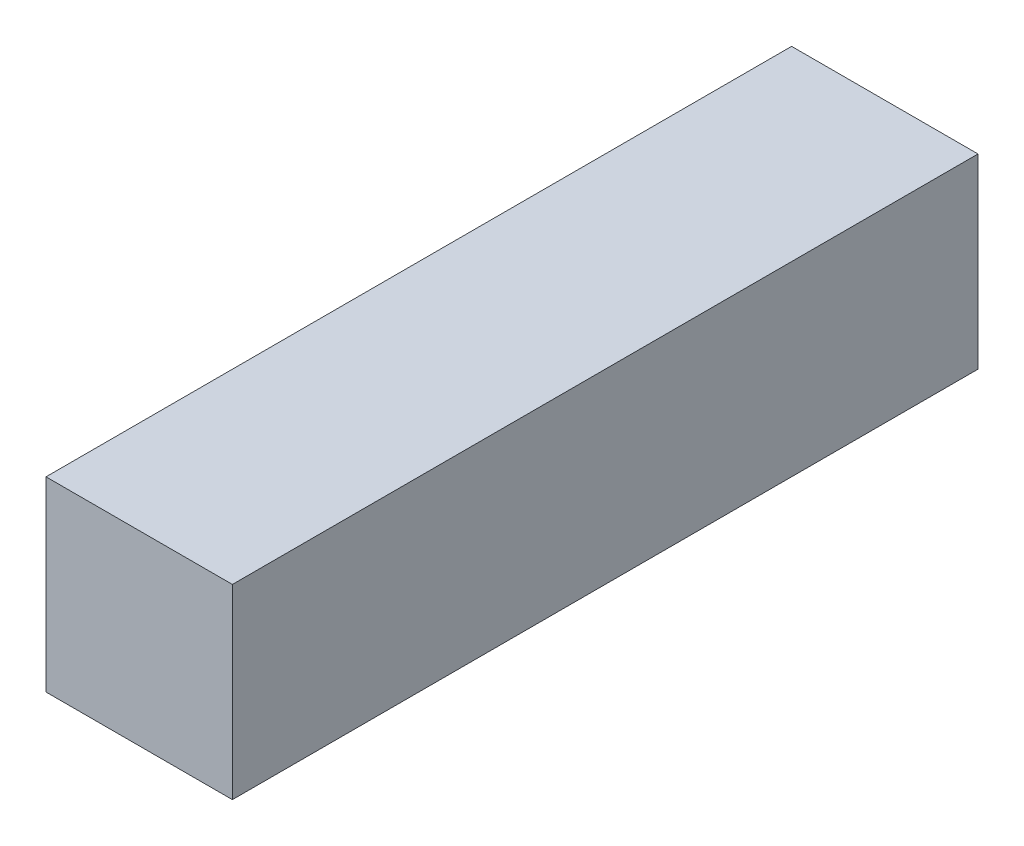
from build123d import *

# Parameters (mm, degrees)
SKIZZE1_W               = 20
SKIZZE1_H               = 20
LINEAR_AUSTRAGEN1_DEPTH = 80


with BuildPart() as part:
    # Skizze1 → Linear austragen1 (new body)
    with BuildSketch(Plane.XY):
        with Locations((-2.309631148, -3.129508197)):
            Rectangle(SKIZZE1_W, SKIZZE1_H)
    extrude(amount=LINEAR_AUSTRAGEN1_DEPTH)


solid = part.part
